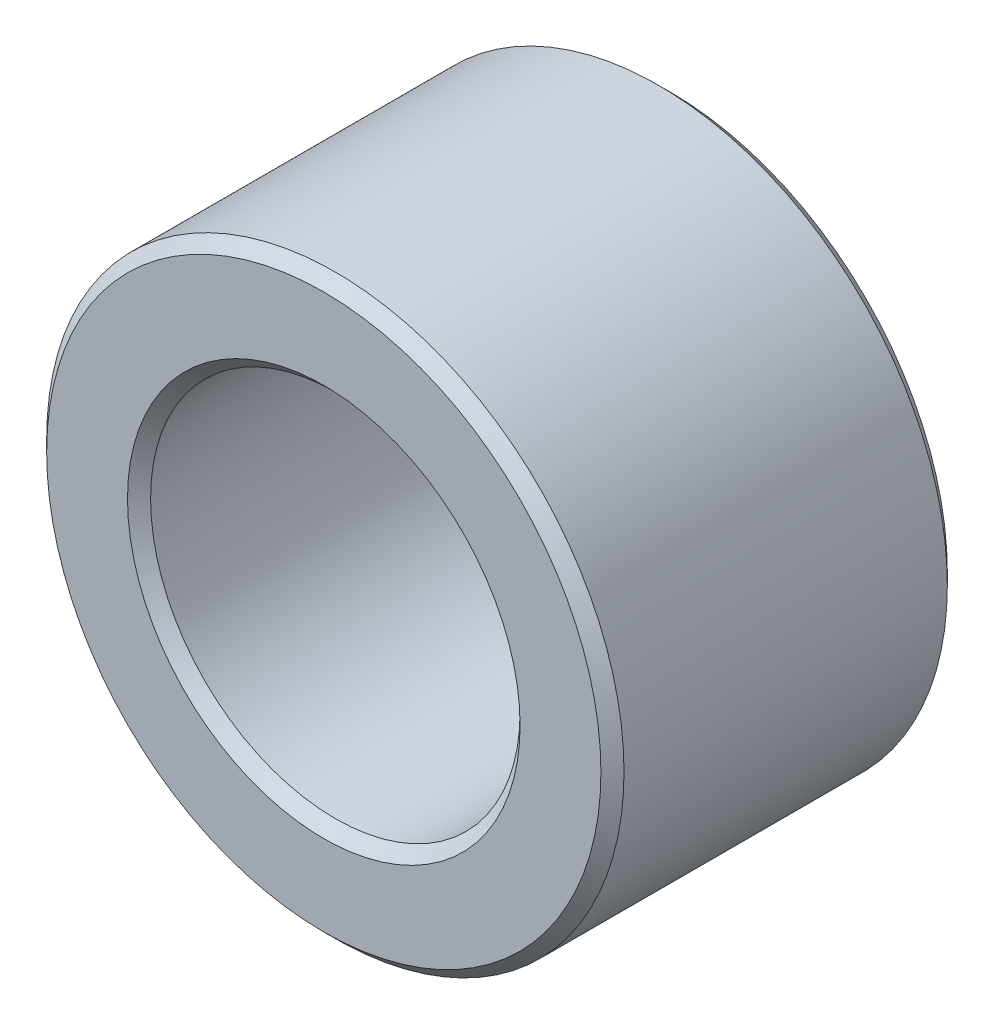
from build123d import *

# Parameters (mm, degrees)
SKETCH1_R           = 5
SKETCH1_R_2         = 3.2
BOSS_EXTRUDE2_DEPTH = 3
CHAMFER3_SIZE       = 0.2


with BuildPart() as part:
    # Sketch1 → Boss-Extrude2 (new, symmetric)
    with BuildSketch(Plane.XY):
        Circle(SKETCH1_R)
        Circle(SKETCH1_R_2, mode=Mode.SUBTRACT)
    extrude(amount=BOSS_EXTRUDE2_DEPTH, both=True)

    # Chamfer3
    chamfer3_edges = [part.edges().sort_by_distance(p)[0] for p in [
        (-5, 0, -3),
        (-5, 0, 3),
        (-3.2, 0, -3),
        (-3.2, 0, 3),
    ]]
    chamfer(chamfer3_edges, length=CHAMFER3_SIZE)


solid = part.part
